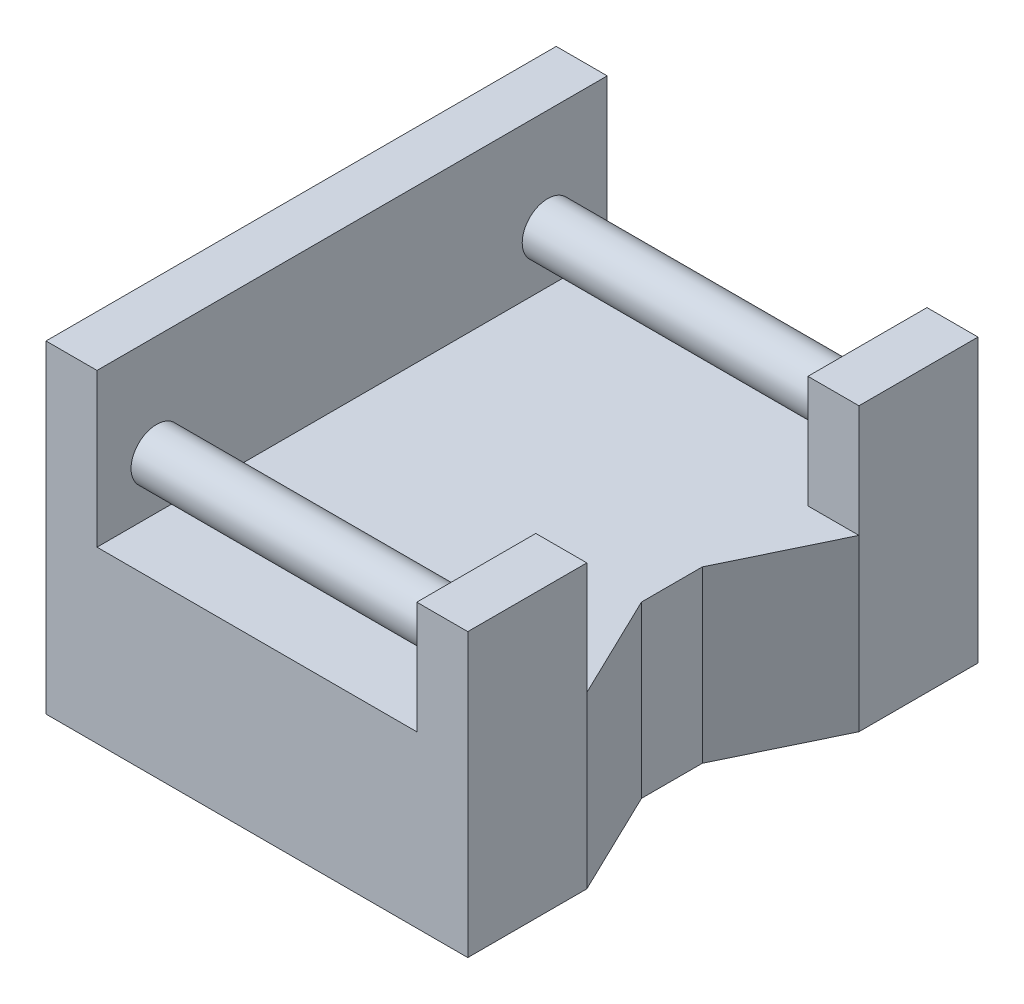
ISO-10303-21;
HEADER;
FILE_DESCRIPTION(('STEP AP214'),'2;1');
FILE_NAME('part.step','',(''),(''),'','','');
FILE_SCHEMA(('AUTOMOTIVE_DESIGN { 1 0 10303 214 1 1 1 1 }'));
ENDSEC;
DATA;
#1=APPLICATION_CONTEXT('core data for automotive mechanical design processes');
#2=APPLICATION_PROTOCOL_DEFINITION('international standard','automotive_design',2000,#1);
#3=PRODUCT_CONTEXT('',#1,'mechanical');
#4=PRODUCT('Part','Part','',(#3));
#5=PRODUCT_RELATED_PRODUCT_CATEGORY('part','',(#4));
#6=PRODUCT_DEFINITION_FORMATION('','',#4);
#7=PRODUCT_DEFINITION_CONTEXT('part definition',#1,'design');
#8=PRODUCT_DEFINITION('design','',#6,#7);
#9=PRODUCT_DEFINITION_SHAPE('','',#8);
#10=(LENGTH_UNIT() NAMED_UNIT(*) SI_UNIT(.MILLI.,.METRE.));
#11=(NAMED_UNIT(*) PLANE_ANGLE_UNIT() SI_UNIT($,.RADIAN.));
#12=(NAMED_UNIT(*) SI_UNIT($,.STERADIAN.) SOLID_ANGLE_UNIT());
#13=UNCERTAINTY_MEASURE_WITH_UNIT(LENGTH_MEASURE(1.E-05),#10,'distance_accuracy_value','');
#14=(GEOMETRIC_REPRESENTATION_CONTEXT(3) GLOBAL_UNCERTAINTY_ASSIGNED_CONTEXT((#13)) GLOBAL_UNIT_ASSIGNED_CONTEXT((#10,
#11,#12)) REPRESENTATION_CONTEXT('',''));
#15=CARTESIAN_POINT('',(0.,0.,0.));
#16=DIRECTION('',(0.,0.,1.));
#17=DIRECTION('',(1.,0.,0.));
#18=AXIS2_PLACEMENT_3D('',#15,#16,#17);
#19=CARTESIAN_POINT('',(-50.9814657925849,21.0820035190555,67.5));
#20=DIRECTION('',(0.,1.,0.));
#21=DIRECTION('',(0.,0.,1.));
#22=AXIS2_PLACEMENT_3D('',#19,#20,#21);
#23=PLANE('',#22);
#24=DIRECTION('',(1.,0.,0.));
#25=VECTOR('',#24,1.);
#26=CARTESIAN_POINT('',(73.0185342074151,21.0820035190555,-47.5));
#27=LINE('',#26,#25);
#28=CARTESIAN_POINT('',(58.0185342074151,21.0820035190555,-47.5));
#29=VERTEX_POINT('',#28);
#30=CARTESIAN_POINT('',(73.0185342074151,21.0820035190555,-47.5));
#31=VERTEX_POINT('',#30);
#32=EDGE_CURVE('E438',#29,#31,#27,.T.);
#33=ORIENTED_EDGE('',*,*,#32,.F.);
#34=DIRECTION('',(0.,0.,1.));
#35=VECTOR('',#34,1.);
#36=CARTESIAN_POINT('',(58.0185342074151,21.0820035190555,-82.5));
#37=LINE('',#36,#35);
#38=CARTESIAN_POINT('',(58.0185342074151,21.0820035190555,-82.5));
#39=VERTEX_POINT('',#38);
#40=EDGE_CURVE('E440',#39,#29,#37,.T.);
#41=ORIENTED_EDGE('',*,*,#40,.F.);
#42=DIRECTION('',(1.,0.,0.));
#43=VECTOR('',#42,1.);
#44=CARTESIAN_POINT('',(-50.9814657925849,21.0820035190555,-82.5));
#45=LINE('',#44,#43);
#46=CARTESIAN_POINT('',(-35.9814657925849,21.0820035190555,-82.5));
#47=VERTEX_POINT('',#46);
#48=EDGE_CURVE('E506',#47,#39,#45,.T.);
#49=ORIENTED_EDGE('',*,*,#48,.F.);
#50=DIRECTION('',(0.,0.,-1.));
#51=VECTOR('',#50,1.);
#52=CARTESIAN_POINT('',(-35.9814657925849,21.0820035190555,-82.5));
#53=LINE('',#52,#51);
#54=CARTESIAN_POINT('',(-35.9814657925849,21.0820035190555,67.5));
#55=VERTEX_POINT('',#54);
#56=EDGE_CURVE('E474',#55,#47,#53,.T.);
#57=ORIENTED_EDGE('',*,*,#56,.F.);
#58=DIRECTION('',(-1.,0.,0.));
#59=VECTOR('',#58,1.);
#60=CARTESIAN_POINT('',(-50.9814657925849,21.0820035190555,67.5));
#61=LINE('',#60,#59);
#62=CARTESIAN_POINT('',(58.0185342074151,21.0820035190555,67.5));
#63=VERTEX_POINT('',#62);
#64=EDGE_CURVE('E323',#63,#55,#61,.T.);
#65=ORIENTED_EDGE('',*,*,#64,.F.);
#66=DIRECTION('',(0.,0.,1.));
#67=VECTOR('',#66,1.);
#68=CARTESIAN_POINT('',(58.0185342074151,21.0820035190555,32.5));
#69=LINE('',#68,#67);
#70=CARTESIAN_POINT('',(58.0185342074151,21.0820035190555,32.5));
#71=VERTEX_POINT('',#70);
#72=EDGE_CURVE('E459',#71,#63,#69,.T.);
#73=ORIENTED_EDGE('',*,*,#72,.F.);
#74=DIRECTION('',(-1.,0.,0.));
#75=VECTOR('',#74,1.);
#76=CARTESIAN_POINT('',(73.0185342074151,21.0820035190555,32.5));
#77=LINE('',#76,#75);
#78=CARTESIAN_POINT('',(73.0185342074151,21.0820035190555,32.5));
#79=VERTEX_POINT('',#78);
#80=EDGE_CURVE('E454',#79,#71,#77,.T.);
#81=ORIENTED_EDGE('',*,*,#80,.F.);
#82=DIRECTION('',(0.434811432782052,0.,0.900521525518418));
#83=VECTOR('',#82,1.);
#84=CARTESIAN_POINT('',(63.2794693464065,21.0820035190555,12.3297908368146));
#85=LINE('',#84,#83);
#86=CARTESIAN_POINT('',(58.0185342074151,21.0820035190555,1.4340668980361));
#87=VERTEX_POINT('',#86);
#88=EDGE_CURVE('E496',#87,#79,#85,.T.);
#89=ORIENTED_EDGE('',*,*,#88,.F.);
#90=DIRECTION('',(0.,0.,1.));
#91=VECTOR('',#90,1.);
#92=CARTESIAN_POINT('',(58.018534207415,21.0820035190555,67.5000000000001));
#93=LINE('',#92,#91);
#94=CARTESIAN_POINT('',(58.0185342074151,21.0820035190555,-16.4340668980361));
#95=VERTEX_POINT('',#94);
#96=EDGE_CURVE('E500',#95,#87,#93,.T.);
#97=ORIENTED_EDGE('',*,*,#96,.F.);
#98=DIRECTION('',(-0.434811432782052,0.,0.900521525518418));
#99=VECTOR('',#98,1.);
#100=CARTESIAN_POINT('',(4.54591113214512,21.0820035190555,94.3110618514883));
#101=LINE('',#100,#99);
#102=EDGE_CURVE('E503',#31,#95,#101,.T.);
#103=ORIENTED_EDGE('',*,*,#102,.F.);
#104=EDGE_LOOP('',(#33,#41,#49,#57,#65,#73,#81,#89,#97,#103));
#105=FACE_BOUND('',#104,.T.);
#106=ADVANCED_FACE('F302',(#105),#23,.T.);
#107=CARTESIAN_POINT('',(-50.9814657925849,21.0820035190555,67.5));
#108=DIRECTION('',(0.,0.,1.));
#109=DIRECTION('',(1.,0.,0.));
#110=AXIS2_PLACEMENT_3D('',#107,#108,#109);
#111=PLANE('',#110);
#112=DIRECTION('',(-1.,0.,0.));
#113=VECTOR('',#112,1.);
#114=CARTESIAN_POINT('',(-50.9814657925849,-28.9179964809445,67.5));
#115=LINE('',#114,#113);
#116=CARTESIAN_POINT('',(73.0185342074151,-28.9179964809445,67.5));
#117=VERTEX_POINT('',#116);
#118=CARTESIAN_POINT('',(-50.9814657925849,-28.9179964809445,67.5));
#119=VERTEX_POINT('',#118);
#120=EDGE_CURVE('E494',#117,#119,#115,.T.);
#121=ORIENTED_EDGE('',*,*,#120,.F.);
#122=DIRECTION('',(0.,-1.,0.));
#123=VECTOR('',#122,1.);
#124=CARTESIAN_POINT('',(73.0185342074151,21.0820035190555,67.5));
#125=LINE('',#124,#123);
#126=CARTESIAN_POINT('',(73.0185342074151,54.0820035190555,67.5));
#127=VERTEX_POINT('',#126);
#128=EDGE_CURVE('E537',#127,#117,#125,.T.);
#129=ORIENTED_EDGE('',*,*,#128,.F.);
#130=DIRECTION('',(1.,0.,0.));
#131=VECTOR('',#130,1.);
#132=CARTESIAN_POINT('',(73.0185342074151,54.0820035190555,67.5));
#133=LINE('',#132,#131);
#134=CARTESIAN_POINT('',(58.0185342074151,54.0820035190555,67.5));
#135=VERTEX_POINT('',#134);
#136=EDGE_CURVE('E463',#135,#127,#133,.T.);
#137=ORIENTED_EDGE('',*,*,#136,.F.);
#138=DIRECTION('',(0.,-1.,0.));
#139=VECTOR('',#138,1.);
#140=CARTESIAN_POINT('',(58.0185342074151,54.0820035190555,67.5));
#141=LINE('',#140,#139);
#142=EDGE_CURVE('E318',#135,#63,#141,.T.);
#143=ORIENTED_EDGE('',*,*,#142,.T.);
#144=ORIENTED_EDGE('',*,*,#64,.T.);
#145=DIRECTION('',(0.,-1.,0.));
#146=VECTOR('',#145,1.);
#147=CARTESIAN_POINT('',(-35.9814657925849,66.0820035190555,67.5));
#148=LINE('',#147,#146);
#149=CARTESIAN_POINT('',(-35.9814657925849,66.0820035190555,67.5));
#150=VERTEX_POINT('',#149);
#151=EDGE_CURVE('E486',#150,#55,#148,.T.);
#152=ORIENTED_EDGE('',*,*,#151,.F.);
#153=DIRECTION('',(1.,0.,0.));
#154=VECTOR('',#153,1.);
#155=CARTESIAN_POINT('',(-35.9814657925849,66.0820035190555,67.5));
#156=LINE('',#155,#154);
#157=CARTESIAN_POINT('',(-50.9814657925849,66.0820035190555,67.5));
#158=VERTEX_POINT('',#157);
#159=EDGE_CURVE('E484',#158,#150,#156,.T.);
#160=ORIENTED_EDGE('',*,*,#159,.F.);
#161=DIRECTION('',(0.,-1.,0.));
#162=VECTOR('',#161,1.);
#163=CARTESIAN_POINT('',(-50.9814657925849,21.0820035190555,67.5));
#164=LINE('',#163,#162);
#165=EDGE_CURVE('E508',#158,#119,#164,.T.);
#166=ORIENTED_EDGE('',*,*,#165,.T.);
#167=EDGE_LOOP('',(#121,#129,#137,#143,#144,#152,#160,#166));
#168=FACE_BOUND('',#167,.T.);
#169=ADVANCED_FACE('F304',(#168),#111,.T.);
#170=CARTESIAN_POINT('',(73.0185342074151,21.0820035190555,67.5));
#171=DIRECTION('',(1.,0.,0.));
#172=DIRECTION('',(0.,0.,-1.));
#173=AXIS2_PLACEMENT_3D('',#170,#171,#172);
#174=PLANE('',#173);
#175=DIRECTION('',(0.,0.,1.));
#176=VECTOR('',#175,1.);
#177=CARTESIAN_POINT('',(73.0185342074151,-28.9179964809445,67.5));
#178=LINE('',#177,#176);
#179=CARTESIAN_POINT('',(73.0185342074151,-28.9179964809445,32.5));
#180=VERTEX_POINT('',#179);
#181=EDGE_CURVE('E511',#180,#117,#178,.T.);
#182=ORIENTED_EDGE('',*,*,#181,.F.);
#183=DIRECTION('',(0.,-1.,0.));
#184=VECTOR('',#183,1.);
#185=CARTESIAN_POINT('',(73.0185342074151,21.0820035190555,32.5));
#186=LINE('',#185,#184);
#187=EDGE_CURVE('E535',#79,#180,#186,.T.);
#188=ORIENTED_EDGE('',*,*,#187,.F.);
#189=DIRECTION('',(0.,-1.,0.));
#190=VECTOR('',#189,1.);
#191=CARTESIAN_POINT('',(73.0185342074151,54.0820035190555,32.5));
#192=LINE('',#191,#190);
#193=CARTESIAN_POINT('',(73.0185342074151,54.0820035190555,32.5));
#194=VERTEX_POINT('',#193);
#195=EDGE_CURVE('E472',#194,#79,#192,.T.);
#196=ORIENTED_EDGE('',*,*,#195,.F.);
#197=DIRECTION('',(0.,0.,-1.));
#198=VECTOR('',#197,1.);
#199=CARTESIAN_POINT('',(73.0185342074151,54.0820035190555,32.5));
#200=LINE('',#199,#198);
#201=EDGE_CURVE('E455',#127,#194,#200,.T.);
#202=ORIENTED_EDGE('',*,*,#201,.F.);
#203=ORIENTED_EDGE('',*,*,#128,.T.);
#204=EDGE_LOOP('',(#182,#188,#196,#202,#203));
#205=FACE_BOUND('',#204,.T.);
#206=ADVANCED_FACE('F586',(#205),#174,.T.);
#207=CARTESIAN_POINT('',(63.2794693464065,21.0820035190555,12.3297908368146));
#208=DIRECTION('',(0.900521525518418,0.,-0.434811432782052));
#209=DIRECTION('',(-0.434811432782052,0.,-0.900521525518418));
#210=AXIS2_PLACEMENT_3D('',#207,#208,#209);
#211=PLANE('',#210);
#212=DIRECTION('',(0.434811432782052,0.,0.900521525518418));
#213=VECTOR('',#212,1.);
#214=CARTESIAN_POINT('',(63.2794693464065,-28.9179964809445,12.3297908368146));
#215=LINE('',#214,#213);
#216=CARTESIAN_POINT('',(58.0185342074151,-28.9179964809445,1.4340668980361));
#217=VERTEX_POINT('',#216);
#218=EDGE_CURVE('E514',#217,#180,#215,.T.);
#219=ORIENTED_EDGE('',*,*,#218,.F.);
#220=DIRECTION('',(0.,-1.,0.));
#221=VECTOR('',#220,1.);
#222=CARTESIAN_POINT('',(58.0185342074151,21.0820035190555,1.4340668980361));
#223=LINE('',#222,#221);
#224=EDGE_CURVE('E533',#87,#217,#223,.T.);
#225=ORIENTED_EDGE('',*,*,#224,.F.);
#226=ORIENTED_EDGE('',*,*,#88,.T.);
#227=ORIENTED_EDGE('',*,*,#187,.T.);
#228=EDGE_LOOP('',(#219,#225,#226,#227));
#229=FACE_BOUND('',#228,.T.);
#230=ADVANCED_FACE('F627',(#229),#211,.T.);
#231=CARTESIAN_POINT('',(58.018534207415,21.0820035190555,67.5000000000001));
#232=DIRECTION('',(1.,0.,0.));
#233=DIRECTION('',(0.,0.,-1.));
#234=AXIS2_PLACEMENT_3D('',#231,#232,#233);
#235=PLANE('',#234);
#236=DIRECTION('',(0.,0.,1.));
#237=VECTOR('',#236,1.);
#238=CARTESIAN_POINT('',(58.018534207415,-28.9179964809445,67.5000000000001));
#239=LINE('',#238,#237);
#240=CARTESIAN_POINT('',(58.0185342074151,-28.9179964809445,-16.4340668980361));
#241=VERTEX_POINT('',#240);
#242=EDGE_CURVE('E517',#241,#217,#239,.T.);
#243=ORIENTED_EDGE('',*,*,#242,.F.);
#244=DIRECTION('',(0.,-1.,0.));
#245=VECTOR('',#244,1.);
#246=CARTESIAN_POINT('',(58.0185342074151,21.0820035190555,-16.4340668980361));
#247=LINE('',#246,#245);
#248=EDGE_CURVE('E531',#95,#241,#247,.T.);
#249=ORIENTED_EDGE('',*,*,#248,.F.);
#250=ORIENTED_EDGE('',*,*,#96,.T.);
#251=ORIENTED_EDGE('',*,*,#224,.T.);
#252=EDGE_LOOP('',(#243,#249,#250,#251));
#253=FACE_BOUND('',#252,.T.);
#254=ADVANCED_FACE('F624',(#253),#235,.T.);
#255=CARTESIAN_POINT('',(4.54591113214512,21.0820035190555,94.3110618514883));
#256=DIRECTION('',(0.900521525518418,0.,0.434811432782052));
#257=DIRECTION('',(0.434811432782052,0.,-0.900521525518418));
#258=AXIS2_PLACEMENT_3D('',#255,#256,#257);
#259=PLANE('',#258);
#260=DIRECTION('',(-0.434811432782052,0.,0.900521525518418));
#261=VECTOR('',#260,1.);
#262=CARTESIAN_POINT('',(4.54591113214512,-28.9179964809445,94.3110618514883));
#263=LINE('',#262,#261);
#264=CARTESIAN_POINT('',(73.0185342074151,-28.9179964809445,-47.5));
#265=VERTEX_POINT('',#264);
#266=EDGE_CURVE('E520',#265,#241,#263,.T.);
#267=ORIENTED_EDGE('',*,*,#266,.F.);
#268=DIRECTION('',(0.,-1.,0.));
#269=VECTOR('',#268,1.);
#270=CARTESIAN_POINT('',(73.0185342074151,21.0820035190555,-47.5));
#271=LINE('',#270,#269);
#272=EDGE_CURVE('E422',#31,#265,#271,.T.);
#273=ORIENTED_EDGE('',*,*,#272,.F.);
#274=ORIENTED_EDGE('',*,*,#102,.T.);
#275=ORIENTED_EDGE('',*,*,#248,.T.);
#276=EDGE_LOOP('',(#267,#273,#274,#275));
#277=FACE_BOUND('',#276,.T.);
#278=ADVANCED_FACE('F568',(#277),#259,.T.);
#279=CARTESIAN_POINT('',(73.0185342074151,21.0820035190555,67.4999999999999));
#280=DIRECTION('',(1.,0.,0.));
#281=DIRECTION('',(0.,0.,-1.));
#282=AXIS2_PLACEMENT_3D('',#279,#280,#281);
#283=PLANE('',#282);
#284=DIRECTION('',(0.,0.,1.));
#285=VECTOR('',#284,1.);
#286=CARTESIAN_POINT('',(73.0185342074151,-28.9179964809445,67.4999999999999));
#287=LINE('',#286,#285);
#288=CARTESIAN_POINT('',(73.0185342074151,-28.9179964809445,-82.5));
#289=VERTEX_POINT('',#288);
#290=EDGE_CURVE('E418',#289,#265,#287,.T.);
#291=ORIENTED_EDGE('',*,*,#290,.F.);
#292=DIRECTION('',(0.,-1.,0.));
#293=VECTOR('',#292,1.);
#294=CARTESIAN_POINT('',(73.0185342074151,21.0820035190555,-82.5));
#295=LINE('',#294,#293);
#296=CARTESIAN_POINT('',(73.0185342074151,54.0820035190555,-82.5));
#297=VERTEX_POINT('',#296);
#298=EDGE_CURVE('E411',#297,#289,#295,.T.);
#299=ORIENTED_EDGE('',*,*,#298,.F.);
#300=DIRECTION('',(0.,0.,-1.));
#301=VECTOR('',#300,1.);
#302=CARTESIAN_POINT('',(73.0185342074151,54.0820035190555,-82.5));
#303=LINE('',#302,#301);
#304=CARTESIAN_POINT('',(73.0185342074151,54.0820035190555,-47.5));
#305=VERTEX_POINT('',#304);
#306=EDGE_CURVE('E416',#305,#297,#303,.T.);
#307=ORIENTED_EDGE('',*,*,#306,.F.);
#308=DIRECTION('',(0.,-1.,0.));
#309=VECTOR('',#308,1.);
#310=CARTESIAN_POINT('',(73.0185342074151,54.0820035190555,-47.5));
#311=LINE('',#310,#309);
#312=EDGE_CURVE('E447',#305,#31,#311,.T.);
#313=ORIENTED_EDGE('',*,*,#312,.T.);
#314=ORIENTED_EDGE('',*,*,#272,.T.);
#315=EDGE_LOOP('',(#291,#299,#307,#313,#314));
#316=FACE_BOUND('',#315,.T.);
#317=ADVANCED_FACE('F413',(#316),#283,.T.);
#318=CARTESIAN_POINT('',(-50.9814657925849,21.0820035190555,-82.5));
#319=DIRECTION('',(0.,0.,-1.));
#320=DIRECTION('',(-1.,0.,0.));
#321=AXIS2_PLACEMENT_3D('',#318,#319,#320);
#322=PLANE('',#321);
#323=DIRECTION('',(1.,0.,0.));
#324=VECTOR('',#323,1.);
#325=CARTESIAN_POINT('',(-50.9814657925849,-28.9179964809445,-82.5));
#326=LINE('',#325,#324);
#327=CARTESIAN_POINT('',(-50.9814657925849,-28.9179964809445,-82.5));
#328=VERTEX_POINT('',#327);
#329=EDGE_CURVE('E524',#328,#289,#326,.T.);
#330=ORIENTED_EDGE('',*,*,#329,.F.);
#331=DIRECTION('',(0.,-1.,0.));
#332=VECTOR('',#331,1.);
#333=CARTESIAN_POINT('',(-50.9814657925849,21.0820035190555,-82.5));
#334=LINE('',#333,#332);
#335=CARTESIAN_POINT('',(-50.9814657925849,66.0820035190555,-82.5));
#336=VERTEX_POINT('',#335);
#337=EDGE_CURVE('E423',#336,#328,#334,.T.);
#338=ORIENTED_EDGE('',*,*,#337,.F.);
#339=DIRECTION('',(-1.,0.,0.));
#340=VECTOR('',#339,1.);
#341=CARTESIAN_POINT('',(-35.9814657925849,66.0820035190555,-82.5));
#342=LINE('',#341,#340);
#343=CARTESIAN_POINT('',(-35.9814657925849,66.0820035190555,-82.5));
#344=VERTEX_POINT('',#343);
#345=EDGE_CURVE('E478',#344,#336,#342,.T.);
#346=ORIENTED_EDGE('',*,*,#345,.F.);
#347=DIRECTION('',(0.,-1.,0.));
#348=VECTOR('',#347,1.);
#349=CARTESIAN_POINT('',(-35.9814657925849,66.0820035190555,-82.5));
#350=LINE('',#349,#348);
#351=EDGE_CURVE('E491',#344,#47,#350,.T.);
#352=ORIENTED_EDGE('',*,*,#351,.T.);
#353=ORIENTED_EDGE('',*,*,#48,.T.);
#354=DIRECTION('',(0.,-1.,0.));
#355=VECTOR('',#354,1.);
#356=CARTESIAN_POINT('',(58.0185342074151,54.0820035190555,-82.5));
#357=LINE('',#356,#355);
#358=CARTESIAN_POINT('',(58.0185342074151,54.0820035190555,-82.5));
#359=VERTEX_POINT('',#358);
#360=EDGE_CURVE('E429',#359,#39,#357,.T.);
#361=ORIENTED_EDGE('',*,*,#360,.F.);
#362=DIRECTION('',(-1.,0.,0.));
#363=VECTOR('',#362,1.);
#364=CARTESIAN_POINT('',(73.0185342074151,54.0820035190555,-82.5));
#365=LINE('',#364,#363);
#366=EDGE_CURVE('E426',#297,#359,#365,.T.);
#367=ORIENTED_EDGE('',*,*,#366,.F.);
#368=ORIENTED_EDGE('',*,*,#298,.T.);
#369=EDGE_LOOP('',(#330,#338,#346,#352,#353,#361,#367,#368));
#370=FACE_BOUND('',#369,.T.);
#371=ADVANCED_FACE('F427',(#370),#322,.T.);
#372=CARTESIAN_POINT('',(-50.9814657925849,21.0820035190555,67.5));
#373=DIRECTION('',(-1.,0.,0.));
#374=DIRECTION('',(0.,0.,1.));
#375=AXIS2_PLACEMENT_3D('',#372,#373,#374);
#376=PLANE('',#375);
#377=DIRECTION('',(0.,0.,-1.));
#378=VECTOR('',#377,1.);
#379=CARTESIAN_POINT('',(-50.9814657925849,-28.9179964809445,67.5));
#380=LINE('',#379,#378);
#381=EDGE_CURVE('E497',#119,#328,#380,.T.);
#382=ORIENTED_EDGE('',*,*,#381,.F.);
#383=ORIENTED_EDGE('',*,*,#165,.F.);
#384=DIRECTION('',(0.,0.,1.));
#385=VECTOR('',#384,1.);
#386=CARTESIAN_POINT('',(-50.9814657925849,66.0820035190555,-82.5));
#387=LINE('',#386,#385);
#388=EDGE_CURVE('E481',#336,#158,#387,.T.);
#389=ORIENTED_EDGE('',*,*,#388,.F.);
#390=ORIENTED_EDGE('',*,*,#337,.T.);
#391=EDGE_LOOP('',(#382,#383,#389,#390));
#392=FACE_BOUND('',#391,.T.);
#393=ADVANCED_FACE('F580',(#392),#376,.T.);
#394=CARTESIAN_POINT('',(-50.9814657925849,-28.9179964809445,67.5));
#395=DIRECTION('',(0.,1.,0.));
#396=DIRECTION('',(0.,0.,1.));
#397=AXIS2_PLACEMENT_3D('',#394,#395,#396);
#398=PLANE('',#397);
#399=ORIENTED_EDGE('',*,*,#120,.T.);
#400=ORIENTED_EDGE('',*,*,#381,.T.);
#401=ORIENTED_EDGE('',*,*,#329,.T.);
#402=ORIENTED_EDGE('',*,*,#290,.T.);
#403=ORIENTED_EDGE('',*,*,#266,.T.);
#404=ORIENTED_EDGE('',*,*,#242,.T.);
#405=ORIENTED_EDGE('',*,*,#218,.T.);
#406=ORIENTED_EDGE('',*,*,#181,.T.);
#407=EDGE_LOOP('',(#399,#400,#401,#402,#403,#404,#405,#406));
#408=FACE_BOUND('',#407,.T.);
#409=ADVANCED_FACE('F571',(#408),#398,.F.);
#410=CARTESIAN_POINT('',(-35.9814657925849,66.0820035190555,-82.5));
#411=DIRECTION('',(-1.,0.,0.));
#412=DIRECTION('',(0.,0.,1.));
#413=AXIS2_PLACEMENT_3D('',#410,#411,#412);
#414=PLANE('',#413);
#415=CARTESIAN_POINT('',(-35.9814657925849,36.0820035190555,-65.));
#416=DIRECTION('',(-1.,0.,0.));
#417=DIRECTION('',(0.,0.,1.));
#418=AXIS2_PLACEMENT_3D('',#415,#416,#417);
#419=CIRCLE('',#418,7.50000000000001);
#420=CARTESIAN_POINT('',(-35.9814657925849,36.0820035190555,-57.5));
#421=VERTEX_POINT('',#420);
#422=EDGE_CURVE('E12',#421,#421,#419,.F.);
#423=ORIENTED_EDGE('',*,*,#422,.F.);
#424=EDGE_LOOP('',(#423));
#425=FACE_BOUND('',#424,.T.);
#426=CARTESIAN_POINT('',(-35.9814657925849,36.0820035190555,50.));
#427=DIRECTION('',(-1.,0.,0.));
#428=DIRECTION('',(0.,0.,1.));
#429=AXIS2_PLACEMENT_3D('',#426,#427,#428);
#430=CIRCLE('',#429,7.5);
#431=CARTESIAN_POINT('',(-35.9814657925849,36.0820035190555,57.5));
#432=VERTEX_POINT('',#431);
#433=EDGE_CURVE('E443',#432,#432,#430,.F.);
#434=ORIENTED_EDGE('',*,*,#433,.F.);
#435=EDGE_LOOP('',(#434));
#436=FACE_BOUND('',#435,.T.);
#437=ORIENTED_EDGE('',*,*,#56,.T.);
#438=ORIENTED_EDGE('',*,*,#351,.F.);
#439=DIRECTION('',(0.,0.,-1.));
#440=VECTOR('',#439,1.);
#441=CARTESIAN_POINT('',(-35.9814657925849,66.0820035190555,-82.5));
#442=LINE('',#441,#440);
#443=EDGE_CURVE('E475',#150,#344,#442,.T.);
#444=ORIENTED_EDGE('',*,*,#443,.F.);
#445=ORIENTED_EDGE('',*,*,#151,.T.);
#446=EDGE_LOOP('',(#437,#438,#444,#445));
#447=FACE_BOUND('',#446,.T.);
#448=ADVANCED_FACE('F597',(#425,#436,#447),#414,.F.);
#449=CARTESIAN_POINT('',(-50.9814657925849,66.0820035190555,67.5));
#450=DIRECTION('',(0.,-1.,0.));
#451=DIRECTION('',(0.,0.,-1.));
#452=AXIS2_PLACEMENT_3D('',#449,#450,#451);
#453=PLANE('',#452);
#454=ORIENTED_EDGE('',*,*,#443,.T.);
#455=ORIENTED_EDGE('',*,*,#345,.T.);
#456=ORIENTED_EDGE('',*,*,#388,.T.);
#457=ORIENTED_EDGE('',*,*,#159,.T.);
#458=EDGE_LOOP('',(#454,#455,#456,#457));
#459=FACE_BOUND('',#458,.T.);
#460=ADVANCED_FACE('F576',(#459),#453,.F.);
#461=CARTESIAN_POINT('',(73.0185342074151,54.0820035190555,32.5));
#462=DIRECTION('',(0.,0.,1.));
#463=DIRECTION('',(1.,0.,0.));
#464=AXIS2_PLACEMENT_3D('',#461,#462,#463);
#465=PLANE('',#464);
#466=ORIENTED_EDGE('',*,*,#80,.T.);
#467=DIRECTION('',(0.,-1.,0.));
#468=VECTOR('',#467,1.);
#469=CARTESIAN_POINT('',(58.0185342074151,54.0820035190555,32.5));
#470=LINE('',#469,#468);
#471=CARTESIAN_POINT('',(58.0185342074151,54.0820035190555,32.5));
#472=VERTEX_POINT('',#471);
#473=EDGE_CURVE('E469',#472,#71,#470,.T.);
#474=ORIENTED_EDGE('',*,*,#473,.F.);
#475=DIRECTION('',(-1.,0.,0.));
#476=VECTOR('',#475,1.);
#477=CARTESIAN_POINT('',(73.0185342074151,54.0820035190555,32.5));
#478=LINE('',#477,#476);
#479=EDGE_CURVE('E458',#194,#472,#478,.T.);
#480=ORIENTED_EDGE('',*,*,#479,.F.);
#481=ORIENTED_EDGE('',*,*,#195,.T.);
#482=EDGE_LOOP('',(#466,#474,#480,#481));
#483=FACE_BOUND('',#482,.T.);
#484=ADVANCED_FACE('F605',(#483),#465,.F.);
#485=CARTESIAN_POINT('',(58.0185342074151,54.0820035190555,32.5));
#486=DIRECTION('',(1.,0.,0.));
#487=DIRECTION('',(0.,0.,-1.));
#488=AXIS2_PLACEMENT_3D('',#485,#486,#487);
#489=PLANE('',#488);
#490=CARTESIAN_POINT('',(58.0185342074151,36.0820035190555,50.));
#491=DIRECTION('',(1.,0.,0.));
#492=DIRECTION('',(0.,0.,-1.));
#493=AXIS2_PLACEMENT_3D('',#490,#491,#492);
#494=CIRCLE('',#493,7.5);
#495=CARTESIAN_POINT('',(58.0185342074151,36.0820035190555,42.5));
#496=VERTEX_POINT('',#495);
#497=EDGE_CURVE('E538',#496,#496,#494,.F.);
#498=ORIENTED_EDGE('',*,*,#497,.F.);
#499=EDGE_LOOP('',(#498));
#500=FACE_BOUND('',#499,.T.);
#501=ORIENTED_EDGE('',*,*,#72,.T.);
#502=ORIENTED_EDGE('',*,*,#142,.F.);
#503=DIRECTION('',(0.,0.,1.));
#504=VECTOR('',#503,1.);
#505=CARTESIAN_POINT('',(58.0185342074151,54.0820035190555,32.5));
#506=LINE('',#505,#504);
#507=EDGE_CURVE('E461',#472,#135,#506,.T.);
#508=ORIENTED_EDGE('',*,*,#507,.F.);
#509=ORIENTED_EDGE('',*,*,#473,.T.);
#510=EDGE_LOOP('',(#501,#502,#508,#509));
#511=FACE_BOUND('',#510,.T.);
#512=ADVANCED_FACE('F593',(#500,#511),#489,.F.);
#513=CARTESIAN_POINT('',(-50.9814657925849,54.0820035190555,67.5));
#514=DIRECTION('',(0.,-1.,0.));
#515=DIRECTION('',(0.,0.,-1.));
#516=AXIS2_PLACEMENT_3D('',#513,#514,#515);
#517=PLANE('',#516);
#518=ORIENTED_EDGE('',*,*,#201,.T.);
#519=ORIENTED_EDGE('',*,*,#479,.T.);
#520=ORIENTED_EDGE('',*,*,#507,.T.);
#521=ORIENTED_EDGE('',*,*,#136,.T.);
#522=EDGE_LOOP('',(#518,#519,#520,#521));
#523=FACE_BOUND('',#522,.T.);
#524=ADVANCED_FACE('F555',(#523),#517,.F.);
#525=CARTESIAN_POINT('',(58.0185342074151,54.0820035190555,-82.5));
#526=DIRECTION('',(1.,0.,0.));
#527=DIRECTION('',(0.,0.,-1.));
#528=AXIS2_PLACEMENT_3D('',#525,#526,#527);
#529=PLANE('',#528);
#530=CARTESIAN_POINT('',(58.0185342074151,36.0820035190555,-65.));
#531=DIRECTION('',(1.,0.,0.));
#532=DIRECTION('',(0.,0.,-1.));
#533=AXIS2_PLACEMENT_3D('',#530,#531,#532);
#534=CIRCLE('',#533,7.50000000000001);
#535=CARTESIAN_POINT('',(58.0185342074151,36.0820035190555,-72.5));
#536=VERTEX_POINT('',#535);
#537=EDGE_CURVE('E306',#536,#536,#534,.F.);
#538=ORIENTED_EDGE('',*,*,#537,.F.);
#539=EDGE_LOOP('',(#538));
#540=FACE_BOUND('',#539,.T.);
#541=ORIENTED_EDGE('',*,*,#40,.T.);
#542=DIRECTION('',(0.,-1.,0.));
#543=VECTOR('',#542,1.);
#544=CARTESIAN_POINT('',(58.0185342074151,54.0820035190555,-47.5));
#545=LINE('',#544,#543);
#546=CARTESIAN_POINT('',(58.0185342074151,54.0820035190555,-47.5));
#547=VERTEX_POINT('',#546);
#548=EDGE_CURVE('E450',#547,#29,#545,.T.);
#549=ORIENTED_EDGE('',*,*,#548,.F.);
#550=DIRECTION('',(0.,0.,1.));
#551=VECTOR('',#550,1.);
#552=CARTESIAN_POINT('',(58.0185342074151,54.0820035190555,-82.5));
#553=LINE('',#552,#551);
#554=EDGE_CURVE('E432',#359,#547,#553,.T.);
#555=ORIENTED_EDGE('',*,*,#554,.F.);
#556=ORIENTED_EDGE('',*,*,#360,.T.);
#557=EDGE_LOOP('',(#541,#549,#555,#556));
#558=FACE_BOUND('',#557,.T.);
#559=ADVANCED_FACE('F551',(#540,#558),#529,.F.);
#560=CARTESIAN_POINT('',(73.0185342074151,54.0820035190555,-47.5));
#561=DIRECTION('',(0.,0.,-1.));
#562=DIRECTION('',(-1.,0.,0.));
#563=AXIS2_PLACEMENT_3D('',#560,#561,#562);
#564=PLANE('',#563);
#565=ORIENTED_EDGE('',*,*,#32,.T.);
#566=ORIENTED_EDGE('',*,*,#312,.F.);
#567=DIRECTION('',(1.,0.,0.));
#568=VECTOR('',#567,1.);
#569=CARTESIAN_POINT('',(73.0185342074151,54.0820035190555,-47.5));
#570=LINE('',#569,#568);
#571=EDGE_CURVE('E436',#547,#305,#570,.T.);
#572=ORIENTED_EDGE('',*,*,#571,.F.);
#573=ORIENTED_EDGE('',*,*,#548,.T.);
#574=EDGE_LOOP('',(#565,#566,#572,#573));
#575=FACE_BOUND('',#574,.T.);
#576=ADVANCED_FACE('F554',(#575),#564,.F.);
#577=CARTESIAN_POINT('',(-50.9814657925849,54.0820035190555,67.5));
#578=DIRECTION('',(0.,-1.,0.));
#579=DIRECTION('',(0.,0.,-1.));
#580=AXIS2_PLACEMENT_3D('',#577,#578,#579);
#581=PLANE('',#580);
#582=ORIENTED_EDGE('',*,*,#306,.T.);
#583=ORIENTED_EDGE('',*,*,#366,.T.);
#584=ORIENTED_EDGE('',*,*,#554,.T.);
#585=ORIENTED_EDGE('',*,*,#571,.T.);
#586=EDGE_LOOP('',(#582,#583,#584,#585));
#587=FACE_BOUND('',#586,.T.);
#588=ADVANCED_FACE('F434',(#587),#581,.F.);
#589=CARTESIAN_POINT('',(-41.9814657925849,36.0820035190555,50.));
#590=DIRECTION('',(1.,0.,0.));
#591=DIRECTION('',(0.,0.,-1.));
#592=AXIS2_PLACEMENT_3D('',#589,#590,#591);
#593=CYLINDRICAL_SURFACE('',#592,7.5);
#594=ORIENTED_EDGE('',*,*,#497,.T.);
#595=EDGE_LOOP('',(#594));
#596=FACE_BOUND('',#595,.T.);
#597=ORIENTED_EDGE('',*,*,#433,.T.);
#598=EDGE_LOOP('',(#597));
#599=FACE_BOUND('',#598,.T.);
#600=ADVANCED_FACE('F726',(#596,#599),#593,.T.);
#601=CARTESIAN_POINT('',(-41.9814657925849,36.0820035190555,-65.));
#602=DIRECTION('',(1.,0.,0.));
#603=DIRECTION('',(0.,0.,-1.));
#604=AXIS2_PLACEMENT_3D('',#601,#602,#603);
#605=CYLINDRICAL_SURFACE('',#604,7.50000000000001);
#606=ORIENTED_EDGE('',*,*,#537,.T.);
#607=EDGE_LOOP('',(#606));
#608=FACE_BOUND('',#607,.T.);
#609=ORIENTED_EDGE('',*,*,#422,.T.);
#610=EDGE_LOOP('',(#609));
#611=FACE_BOUND('',#610,.T.);
#612=ADVANCED_FACE('F548',(#608,#611),#605,.T.);
#613=CLOSED_SHELL('',(#106,#169,#206,#230,#254,#278,#317,#371,#393,#409,#448,#460,#484,#512,
#524,#559,#576,#588,#600,#612));
#614=MANIFOLD_SOLID_BREP('B2',#613);
#615=ADVANCED_BREP_SHAPE_REPRESENTATION('',(#18,#614),#14);
#616=SHAPE_DEFINITION_REPRESENTATION(#9,#615);
ENDSEC;
END-ISO-10303-21;
